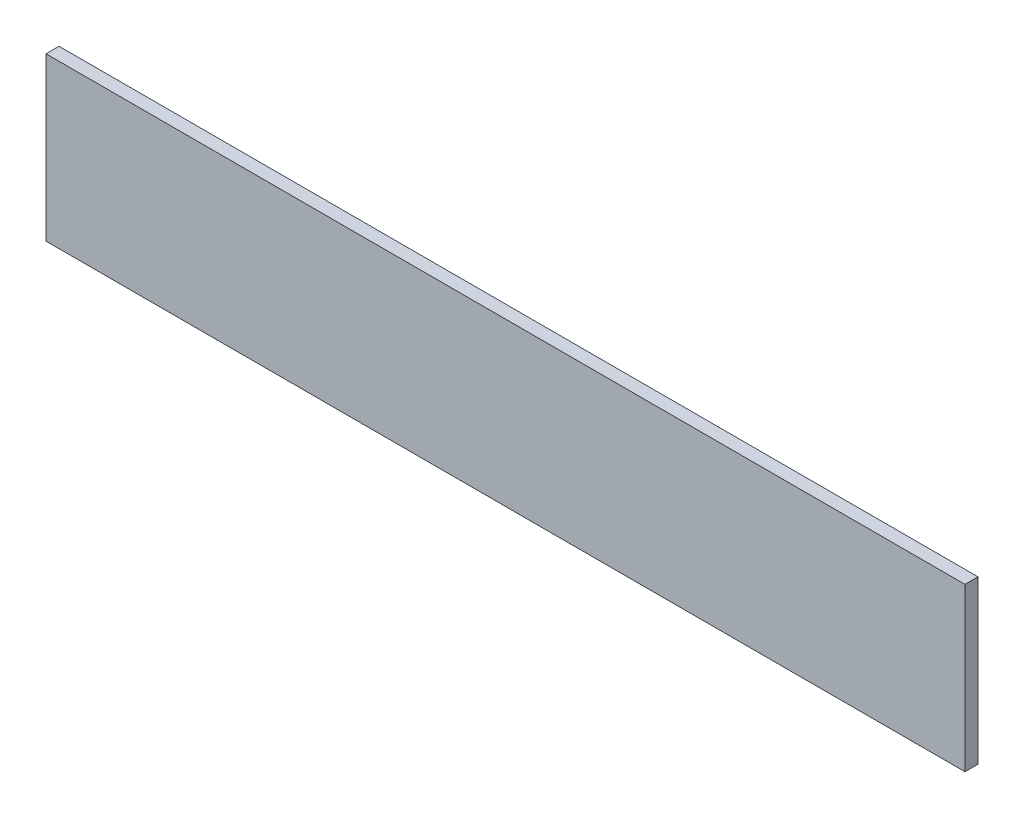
ISO-10303-21;
HEADER;
FILE_DESCRIPTION(('STEP AP214'),'2;1');
FILE_NAME('part.step','',(''),(''),'','','');
FILE_SCHEMA(('AUTOMOTIVE_DESIGN { 1 0 10303 214 1 1 1 1 }'));
ENDSEC;
DATA;
#1=APPLICATION_CONTEXT('core data for automotive mechanical design processes');
#2=APPLICATION_PROTOCOL_DEFINITION('international standard','automotive_design',2000,#1);
#3=PRODUCT_CONTEXT('',#1,'mechanical');
#4=PRODUCT('Part','Part','',(#3));
#5=PRODUCT_RELATED_PRODUCT_CATEGORY('part','',(#4));
#6=PRODUCT_DEFINITION_FORMATION('','',#4);
#7=PRODUCT_DEFINITION_CONTEXT('part definition',#1,'design');
#8=PRODUCT_DEFINITION('design','',#6,#7);
#9=PRODUCT_DEFINITION_SHAPE('','',#8);
#10=(LENGTH_UNIT() NAMED_UNIT(*) SI_UNIT(.MILLI.,.METRE.));
#11=(NAMED_UNIT(*) PLANE_ANGLE_UNIT() SI_UNIT($,.RADIAN.));
#12=(NAMED_UNIT(*) SI_UNIT($,.STERADIAN.) SOLID_ANGLE_UNIT());
#13=UNCERTAINTY_MEASURE_WITH_UNIT(LENGTH_MEASURE(1.E-05),#10,'distance_accuracy_value','');
#14=(GEOMETRIC_REPRESENTATION_CONTEXT(3) GLOBAL_UNCERTAINTY_ASSIGNED_CONTEXT((#13)) GLOBAL_UNIT_ASSIGNED_CONTEXT((#10,
#11,#12)) REPRESENTATION_CONTEXT('',''));
#15=CARTESIAN_POINT('',(0.,0.,0.));
#16=DIRECTION('',(0.,0.,1.));
#17=DIRECTION('',(1.,0.,0.));
#18=AXIS2_PLACEMENT_3D('',#15,#16,#17);
#19=CARTESIAN_POINT('',(0.,0.,1.00000000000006));
#20=DIRECTION('',(0.,0.,1.));
#21=DIRECTION('',(1.,0.,0.));
#22=AXIS2_PLACEMENT_3D('',#19,#20,#21);
#23=PLANE('',#22);
#24=DIRECTION('',(0.,1.,0.));
#25=VECTOR('',#24,1.);
#26=CARTESIAN_POINT('',(-35.227000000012,6.2209999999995,1.00000000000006));
#27=LINE('',#26,#25);
#28=CARTESIAN_POINT('',(-35.227000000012,-6.2209999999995,1.00000000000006));
#29=VERTEX_POINT('',#28);
#30=CARTESIAN_POINT('',(-35.227000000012,6.2209999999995,1.00000000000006));
#31=VERTEX_POINT('',#30);
#32=EDGE_CURVE('E67',#29,#31,#27,.T.);
#33=ORIENTED_EDGE('',*,*,#32,.F.);
#34=DIRECTION('',(1.,0.,0.));
#35=VECTOR('',#34,1.);
#36=CARTESIAN_POINT('',(-35.227000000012,-6.2209999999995,1.00000000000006));
#37=LINE('',#36,#35);
#38=CARTESIAN_POINT('',(35.227000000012,-6.2209999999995,1.00000000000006));
#39=VERTEX_POINT('',#38);
#40=EDGE_CURVE('E19',#39,#29,#37,.F.);
#41=ORIENTED_EDGE('',*,*,#40,.F.);
#42=DIRECTION('',(0.,1.,0.));
#43=VECTOR('',#42,1.);
#44=CARTESIAN_POINT('',(35.227000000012,-6.2209999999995,1.00000000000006));
#45=LINE('',#44,#43);
#46=CARTESIAN_POINT('',(35.227000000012,6.2209999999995,1.00000000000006));
#47=VERTEX_POINT('',#46);
#48=EDGE_CURVE('E57',#47,#39,#45,.F.);
#49=ORIENTED_EDGE('',*,*,#48,.F.);
#50=DIRECTION('',(1.,0.,0.));
#51=VECTOR('',#50,1.);
#52=CARTESIAN_POINT('',(35.227000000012,6.2209999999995,1.00000000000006));
#53=LINE('',#52,#51);
#54=EDGE_CURVE('E52',#31,#47,#53,.T.);
#55=ORIENTED_EDGE('',*,*,#54,.F.);
#56=EDGE_LOOP('',(#33,#41,#49,#55));
#57=FACE_BOUND('',#56,.T.);
#58=ADVANCED_FACE('F16',(#57),#23,.T.);
#59=CARTESIAN_POINT('',(-35.227000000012,-6.2209999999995,0.));
#60=DIRECTION('',(0.,-1.,0.));
#61=DIRECTION('',(0.,0.,-1.));
#62=AXIS2_PLACEMENT_3D('',#59,#60,#61);
#63=PLANE('',#62);
#64=DIRECTION('',(0.,0.,1.));
#65=VECTOR('',#64,1.);
#66=CARTESIAN_POINT('',(-35.227000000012,-6.2209999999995,0.));
#67=LINE('',#66,#65);
#68=CARTESIAN_POINT('',(-35.227000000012,-6.2209999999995,0.));
#69=VERTEX_POINT('',#68);
#70=EDGE_CURVE('E78',#69,#29,#67,.T.);
#71=ORIENTED_EDGE('',*,*,#70,.F.);
#72=DIRECTION('',(1.,0.,0.));
#73=VECTOR('',#72,1.);
#74=CARTESIAN_POINT('',(0.,-6.2209999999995,0.));
#75=LINE('',#74,#73);
#76=CARTESIAN_POINT('',(35.227000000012,-6.2209999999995,0.));
#77=VERTEX_POINT('',#76);
#78=EDGE_CURVE('E73',#69,#77,#75,.T.);
#79=ORIENTED_EDGE('',*,*,#78,.T.);
#80=DIRECTION('',(0.,0.,-1.));
#81=VECTOR('',#80,1.);
#82=CARTESIAN_POINT('',(35.227000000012,-6.2209999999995,0.));
#83=LINE('',#82,#81);
#84=EDGE_CURVE('E62',#39,#77,#83,.T.);
#85=ORIENTED_EDGE('',*,*,#84,.F.);
#86=ORIENTED_EDGE('',*,*,#40,.T.);
#87=EDGE_LOOP('',(#71,#79,#85,#86));
#88=FACE_BOUND('',#87,.T.);
#89=ADVANCED_FACE('F72',(#88),#63,.T.);
#90=CARTESIAN_POINT('',(35.227000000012,-6.2209999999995,0.));
#91=DIRECTION('',(1.,0.,0.));
#92=DIRECTION('',(0.,0.,-1.));
#93=AXIS2_PLACEMENT_3D('',#90,#91,#92);
#94=PLANE('',#93);
#95=ORIENTED_EDGE('',*,*,#84,.T.);
#96=DIRECTION('',(0.,1.,0.));
#97=VECTOR('',#96,1.);
#98=CARTESIAN_POINT('',(35.227000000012,0.,0.));
#99=LINE('',#98,#97);
#100=CARTESIAN_POINT('',(35.227000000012,6.2209999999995,0.));
#101=VERTEX_POINT('',#100);
#102=EDGE_CURVE('E83',#77,#101,#99,.T.);
#103=ORIENTED_EDGE('',*,*,#102,.T.);
#104=DIRECTION('',(0.,0.,1.));
#105=VECTOR('',#104,1.);
#106=CARTESIAN_POINT('',(35.227000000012,6.2209999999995,0.));
#107=LINE('',#106,#105);
#108=EDGE_CURVE('E64',#47,#101,#107,.F.);
#109=ORIENTED_EDGE('',*,*,#108,.F.);
#110=ORIENTED_EDGE('',*,*,#48,.T.);
#111=EDGE_LOOP('',(#95,#103,#109,#110));
#112=FACE_BOUND('',#111,.T.);
#113=ADVANCED_FACE('F59',(#112),#94,.T.);
#114=CARTESIAN_POINT('',(35.227000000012,6.2209999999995,0.));
#115=DIRECTION('',(0.,1.,0.));
#116=DIRECTION('',(0.,0.,1.));
#117=AXIS2_PLACEMENT_3D('',#114,#115,#116);
#118=PLANE('',#117);
#119=ORIENTED_EDGE('',*,*,#108,.T.);
#120=DIRECTION('',(1.,0.,0.));
#121=VECTOR('',#120,1.);
#122=CARTESIAN_POINT('',(0.,6.2209999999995,0.));
#123=LINE('',#122,#121);
#124=CARTESIAN_POINT('',(-35.227000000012,6.2209999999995,0.));
#125=VERTEX_POINT('',#124);
#126=EDGE_CURVE('E25',#101,#125,#123,.F.);
#127=ORIENTED_EDGE('',*,*,#126,.T.);
#128=DIRECTION('',(0.,0.,1.));
#129=VECTOR('',#128,1.);
#130=CARTESIAN_POINT('',(-35.227000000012,6.2209999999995,0.));
#131=LINE('',#130,#129);
#132=EDGE_CURVE('E33',#31,#125,#131,.F.);
#133=ORIENTED_EDGE('',*,*,#132,.F.);
#134=ORIENTED_EDGE('',*,*,#54,.T.);
#135=EDGE_LOOP('',(#119,#127,#133,#134));
#136=FACE_BOUND('',#135,.T.);
#137=ADVANCED_FACE('F87',(#136),#118,.T.);
#138=CARTESIAN_POINT('',(-35.227000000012,6.2209999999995,0.));
#139=DIRECTION('',(-1.,0.,0.));
#140=DIRECTION('',(0.,0.,1.));
#141=AXIS2_PLACEMENT_3D('',#138,#139,#140);
#142=PLANE('',#141);
#143=ORIENTED_EDGE('',*,*,#132,.T.);
#144=DIRECTION('',(0.,1.,0.));
#145=VECTOR('',#144,1.);
#146=CARTESIAN_POINT('',(-35.227000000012,0.,0.));
#147=LINE('',#146,#145);
#148=EDGE_CURVE('E11',#125,#69,#147,.F.);
#149=ORIENTED_EDGE('',*,*,#148,.T.);
#150=ORIENTED_EDGE('',*,*,#70,.T.);
#151=ORIENTED_EDGE('',*,*,#32,.T.);
#152=EDGE_LOOP('',(#143,#149,#150,#151));
#153=FACE_BOUND('',#152,.T.);
#154=ADVANCED_FACE('F90',(#153),#142,.T.);
#155=CARTESIAN_POINT('',(0.,0.,0.));
#156=DIRECTION('',(0.,0.,1.));
#157=DIRECTION('',(1.,0.,0.));
#158=AXIS2_PLACEMENT_3D('',#155,#156,#157);
#159=PLANE('',#158);
#160=ORIENTED_EDGE('',*,*,#126,.F.);
#161=ORIENTED_EDGE('',*,*,#102,.F.);
#162=ORIENTED_EDGE('',*,*,#78,.F.);
#163=ORIENTED_EDGE('',*,*,#148,.F.);
#164=EDGE_LOOP('',(#160,#161,#162,#163));
#165=FACE_BOUND('',#164,.T.);
#166=ADVANCED_FACE('F89',(#165),#159,.F.);
#167=CLOSED_SHELL('',(#58,#89,#113,#137,#154,#166));
#168=MANIFOLD_SOLID_BREP('B1',#167);
#169=ADVANCED_BREP_SHAPE_REPRESENTATION('',(#18,#168),#14);
#170=SHAPE_DEFINITION_REPRESENTATION(#9,#169);
ENDSEC;
END-ISO-10303-21;
